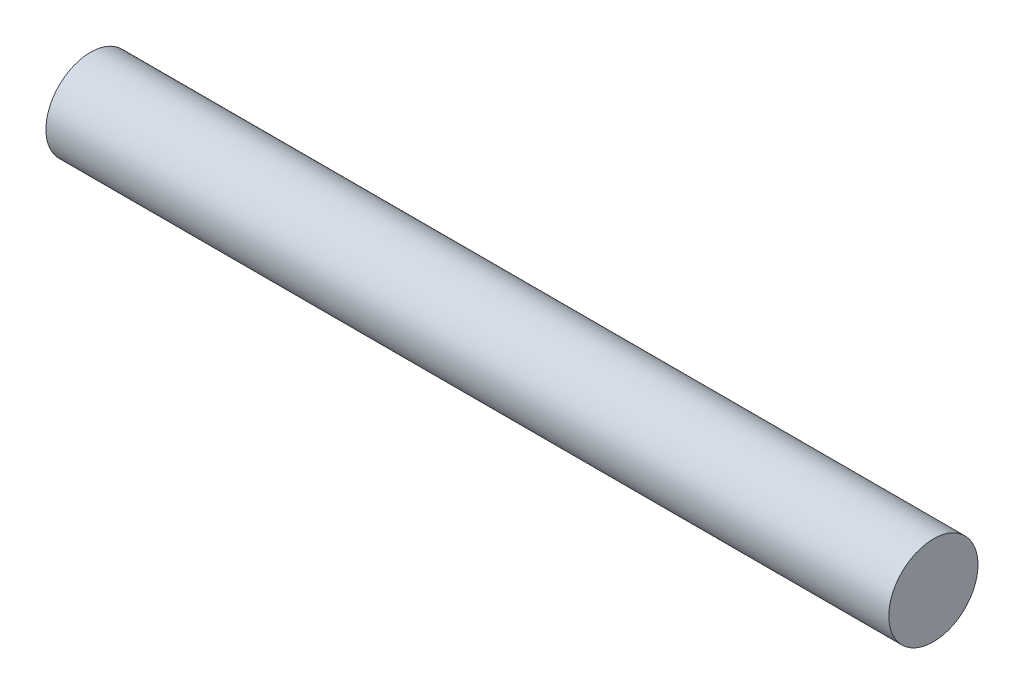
ISO-10303-21;
HEADER;
FILE_DESCRIPTION(('STEP AP214'),'2;1');
FILE_NAME('part.step','',(''),(''),'','','');
FILE_SCHEMA(('AUTOMOTIVE_DESIGN { 1 0 10303 214 1 1 1 1 }'));
ENDSEC;
DATA;
#1=APPLICATION_CONTEXT('core data for automotive mechanical design processes');
#2=APPLICATION_PROTOCOL_DEFINITION('international standard','automotive_design',2000,#1);
#3=PRODUCT_CONTEXT('',#1,'mechanical');
#4=PRODUCT('Part','Part','',(#3));
#5=PRODUCT_RELATED_PRODUCT_CATEGORY('part','',(#4));
#6=PRODUCT_DEFINITION_FORMATION('','',#4);
#7=PRODUCT_DEFINITION_CONTEXT('part definition',#1,'design');
#8=PRODUCT_DEFINITION('design','',#6,#7);
#9=PRODUCT_DEFINITION_SHAPE('','',#8);
#10=(LENGTH_UNIT() NAMED_UNIT(*) SI_UNIT(.MILLI.,.METRE.));
#11=(NAMED_UNIT(*) PLANE_ANGLE_UNIT() SI_UNIT($,.RADIAN.));
#12=(NAMED_UNIT(*) SI_UNIT($,.STERADIAN.) SOLID_ANGLE_UNIT());
#13=UNCERTAINTY_MEASURE_WITH_UNIT(LENGTH_MEASURE(1.E-05),#10,'distance_accuracy_value','');
#14=(GEOMETRIC_REPRESENTATION_CONTEXT(3) GLOBAL_UNCERTAINTY_ASSIGNED_CONTEXT((#13)) GLOBAL_UNIT_ASSIGNED_CONTEXT((#10,
#11,#12)) REPRESENTATION_CONTEXT('',''));
#15=CARTESIAN_POINT('',(0.,0.,0.));
#16=DIRECTION('',(0.,0.,1.));
#17=DIRECTION('',(1.,0.,0.));
#18=AXIS2_PLACEMENT_3D('',#15,#16,#17);
#19=CARTESIAN_POINT('',(30.,0.,0.));
#20=DIRECTION('',(-1.,0.,0.));
#21=DIRECTION('',(0.,0.,1.));
#22=AXIS2_PLACEMENT_3D('',#19,#20,#21);
#23=CYLINDRICAL_SURFACE('',#22,1.5875);
#24=CARTESIAN_POINT('',(30.,0.,0.));
#25=DIRECTION('',(1.,0.,0.));
#26=DIRECTION('',(0.,0.,-1.));
#27=AXIS2_PLACEMENT_3D('',#24,#25,#26);
#28=CIRCLE('',#27,1.5875);
#29=CARTESIAN_POINT('',(30.,0.,-1.5875));
#30=VERTEX_POINT('',#29);
#31=EDGE_CURVE('E10',#30,#30,#28,.T.);
#32=ORIENTED_EDGE('',*,*,#31,.F.);
#33=EDGE_LOOP('',(#32));
#34=FACE_BOUND('',#33,.T.);
#35=CARTESIAN_POINT('',(0.,0.,0.));
#36=DIRECTION('',(1.,0.,0.));
#37=DIRECTION('',(0.,0.,-1.));
#38=AXIS2_PLACEMENT_3D('',#35,#36,#37);
#39=CIRCLE('',#38,1.5875);
#40=CARTESIAN_POINT('',(0.,0.,-1.5875));
#41=VERTEX_POINT('',#40);
#42=EDGE_CURVE('E36',#41,#41,#39,.T.);
#43=ORIENTED_EDGE('',*,*,#42,.T.);
#44=EDGE_LOOP('',(#43));
#45=FACE_BOUND('',#44,.T.);
#46=ADVANCED_FACE('F33',(#34,#45),#23,.T.);
#47=CARTESIAN_POINT('',(30.,0.,0.));
#48=DIRECTION('',(1.,0.,0.));
#49=DIRECTION('',(0.,0.,-1.));
#50=AXIS2_PLACEMENT_3D('',#47,#48,#49);
#51=PLANE('',#50);
#52=ORIENTED_EDGE('',*,*,#31,.T.);
#53=EDGE_LOOP('',(#52));
#54=FACE_BOUND('',#53,.T.);
#55=ADVANCED_FACE('F48',(#54),#51,.T.);
#56=CARTESIAN_POINT('',(0.,0.,0.));
#57=DIRECTION('',(1.,0.,0.));
#58=DIRECTION('',(0.,0.,-1.));
#59=AXIS2_PLACEMENT_3D('',#56,#57,#58);
#60=PLANE('',#59);
#61=ORIENTED_EDGE('',*,*,#42,.F.);
#62=EDGE_LOOP('',(#61));
#63=FACE_BOUND('',#62,.T.);
#64=ADVANCED_FACE('F46',(#63),#60,.F.);
#65=CLOSED_SHELL('',(#46,#55,#64));
#66=MANIFOLD_SOLID_BREP('B2',#65);
#67=ADVANCED_BREP_SHAPE_REPRESENTATION('',(#18,#66),#14);
#68=SHAPE_DEFINITION_REPRESENTATION(#9,#67);
ENDSEC;
END-ISO-10303-21;
